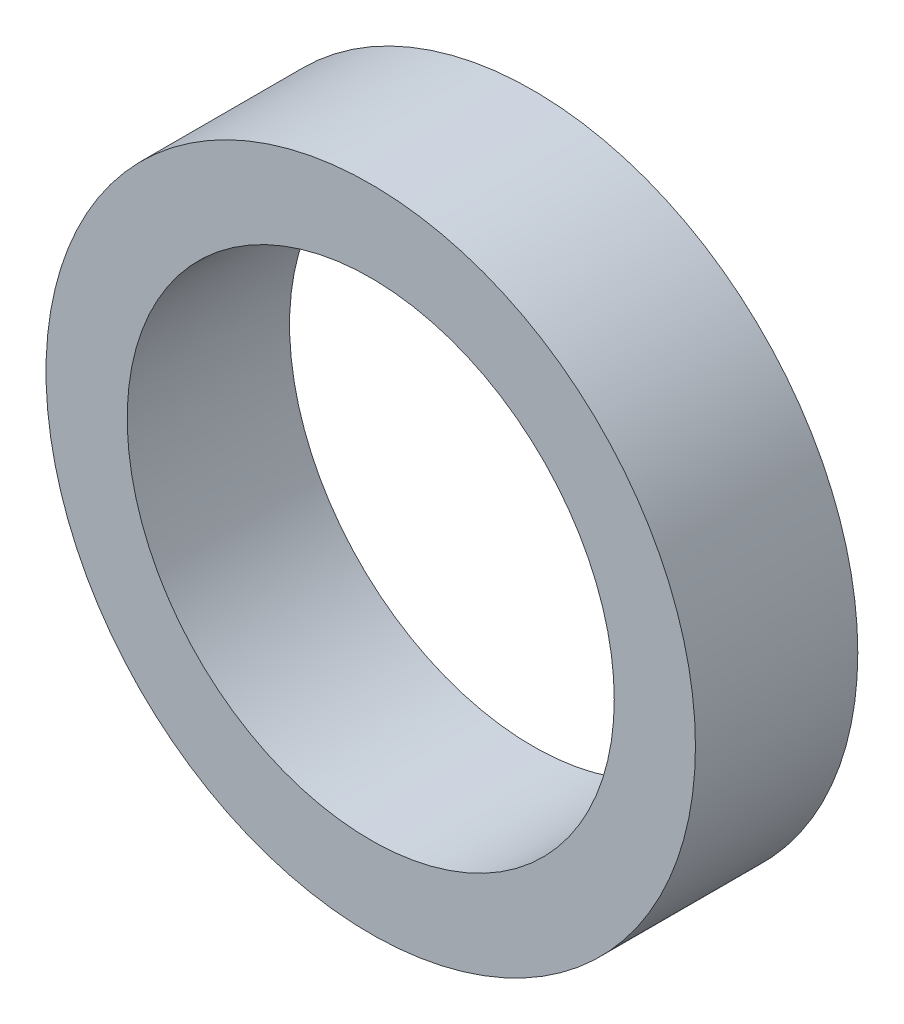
ISO-10303-21;
HEADER;
FILE_DESCRIPTION(('STEP AP214'),'2;1');
FILE_NAME('part.step','',(''),(''),'','','');
FILE_SCHEMA(('AUTOMOTIVE_DESIGN { 1 0 10303 214 1 1 1 1 }'));
ENDSEC;
DATA;
#1=APPLICATION_CONTEXT('core data for automotive mechanical design processes');
#2=APPLICATION_PROTOCOL_DEFINITION('international standard','automotive_design',2000,#1);
#3=PRODUCT_CONTEXT('',#1,'mechanical');
#4=PRODUCT('Part','Part','',(#3));
#5=PRODUCT_RELATED_PRODUCT_CATEGORY('part','',(#4));
#6=PRODUCT_DEFINITION_FORMATION('','',#4);
#7=PRODUCT_DEFINITION_CONTEXT('part definition',#1,'design');
#8=PRODUCT_DEFINITION('design','',#6,#7);
#9=PRODUCT_DEFINITION_SHAPE('','',#8);
#10=(LENGTH_UNIT() NAMED_UNIT(*) SI_UNIT(.MILLI.,.METRE.));
#11=(NAMED_UNIT(*) PLANE_ANGLE_UNIT() SI_UNIT($,.RADIAN.));
#12=(NAMED_UNIT(*) SI_UNIT($,.STERADIAN.) SOLID_ANGLE_UNIT());
#13=UNCERTAINTY_MEASURE_WITH_UNIT(LENGTH_MEASURE(1.E-05),#10,'distance_accuracy_value','');
#14=(GEOMETRIC_REPRESENTATION_CONTEXT(3) GLOBAL_UNCERTAINTY_ASSIGNED_CONTEXT((#13)) GLOBAL_UNIT_ASSIGNED_CONTEXT((#10,
#11,#12)) REPRESENTATION_CONTEXT('',''));
#15=CARTESIAN_POINT('',(0.,0.,0.));
#16=DIRECTION('',(0.,0.,1.));
#17=DIRECTION('',(1.,0.,0.));
#18=AXIS2_PLACEMENT_3D('',#15,#16,#17);
#19=CARTESIAN_POINT('',(0.,0.,6.));
#20=DIRECTION('',(0.,0.,1.));
#21=DIRECTION('',(1.,0.,0.));
#22=AXIS2_PLACEMENT_3D('',#19,#20,#21);
#23=PLANE('',#22);
#24=CARTESIAN_POINT('',(0.,0.,6.));
#25=DIRECTION('',(0.,0.,1.));
#26=DIRECTION('',(1.,0.,0.));
#27=AXIS2_PLACEMENT_3D('',#24,#25,#26);
#28=CIRCLE('',#27,12.);
#29=CARTESIAN_POINT('',(12.,0.,6.));
#30=VERTEX_POINT('',#29);
#31=EDGE_CURVE('E10',#30,#30,#28,.T.);
#32=ORIENTED_EDGE('',*,*,#31,.T.);
#33=EDGE_LOOP('',(#32));
#34=FACE_BOUND('',#33,.T.);
#35=CARTESIAN_POINT('',(0.,0.,6.));
#36=DIRECTION('',(0.,0.,1.));
#37=DIRECTION('',(1.,0.,0.));
#38=AXIS2_PLACEMENT_3D('',#35,#36,#37);
#39=CIRCLE('',#38,9.);
#40=CARTESIAN_POINT('',(9.,0.,6.));
#41=VERTEX_POINT('',#40);
#42=EDGE_CURVE('E43',#41,#41,#39,.T.);
#43=ORIENTED_EDGE('',*,*,#42,.F.);
#44=EDGE_LOOP('',(#43));
#45=FACE_BOUND('',#44,.T.);
#46=ADVANCED_FACE('F32',(#34,#45),#23,.T.);
#47=CARTESIAN_POINT('',(0.,0.,0.));
#48=DIRECTION('',(0.,0.,1.));
#49=DIRECTION('',(1.,0.,0.));
#50=AXIS2_PLACEMENT_3D('',#47,#48,#49);
#51=PLANE('',#50);
#52=CARTESIAN_POINT('',(0.,0.,0.));
#53=DIRECTION('',(0.,0.,1.));
#54=DIRECTION('',(1.,0.,0.));
#55=AXIS2_PLACEMENT_3D('',#52,#53,#54);
#56=CIRCLE('',#55,12.);
#57=CARTESIAN_POINT('',(12.,0.,0.));
#58=VERTEX_POINT('',#57);
#59=EDGE_CURVE('E36',#58,#58,#56,.T.);
#60=ORIENTED_EDGE('',*,*,#59,.F.);
#61=EDGE_LOOP('',(#60));
#62=FACE_BOUND('',#61,.T.);
#63=CARTESIAN_POINT('',(0.,0.,0.));
#64=DIRECTION('',(0.,0.,1.));
#65=DIRECTION('',(1.,0.,0.));
#66=AXIS2_PLACEMENT_3D('',#63,#64,#65);
#67=CIRCLE('',#66,9.);
#68=CARTESIAN_POINT('',(9.,0.,0.));
#69=VERTEX_POINT('',#68);
#70=EDGE_CURVE('E45',#69,#69,#67,.T.);
#71=ORIENTED_EDGE('',*,*,#70,.T.);
#72=EDGE_LOOP('',(#71));
#73=FACE_BOUND('',#72,.T.);
#74=ADVANCED_FACE('F55',(#62,#73),#51,.F.);
#75=CARTESIAN_POINT('',(0.,0.,6.));
#76=DIRECTION('',(0.,0.,-1.));
#77=DIRECTION('',(-1.,0.,0.));
#78=AXIS2_PLACEMENT_3D('',#75,#76,#77);
#79=CYLINDRICAL_SURFACE('',#78,12.);
#80=ORIENTED_EDGE('',*,*,#31,.F.);
#81=EDGE_LOOP('',(#80));
#82=FACE_BOUND('',#81,.T.);
#83=ORIENTED_EDGE('',*,*,#59,.T.);
#84=EDGE_LOOP('',(#83));
#85=FACE_BOUND('',#84,.T.);
#86=ADVANCED_FACE('F34',(#82,#85),#79,.T.);
#87=CARTESIAN_POINT('',(0.,0.,6.));
#88=DIRECTION('',(0.,0.,-1.));
#89=DIRECTION('',(-1.,0.,0.));
#90=AXIS2_PLACEMENT_3D('',#87,#88,#89);
#91=CYLINDRICAL_SURFACE('',#90,9.);
#92=ORIENTED_EDGE('',*,*,#42,.T.);
#93=EDGE_LOOP('',(#92));
#94=FACE_BOUND('',#93,.T.);
#95=ORIENTED_EDGE('',*,*,#70,.F.);
#96=EDGE_LOOP('',(#95));
#97=FACE_BOUND('',#96,.T.);
#98=ADVANCED_FACE('F51',(#94,#97),#91,.F.);
#99=CLOSED_SHELL('',(#46,#74,#86,#98));
#100=MANIFOLD_SOLID_BREP('B2',#99);
#101=ADVANCED_BREP_SHAPE_REPRESENTATION('',(#18,#100),#14);
#102=SHAPE_DEFINITION_REPRESENTATION(#9,#101);
ENDSEC;
END-ISO-10303-21;
